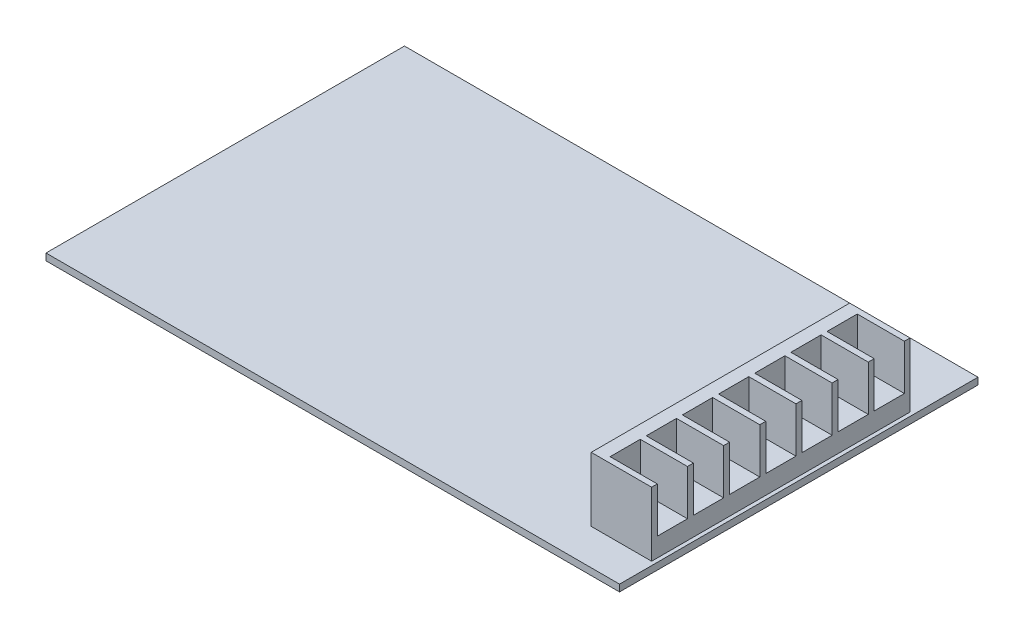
ISO-10303-21;
HEADER;
FILE_DESCRIPTION(('STEP AP214'),'2;1');
FILE_NAME('part.step','',(''),(''),'','','');
FILE_SCHEMA(('AUTOMOTIVE_DESIGN { 1 0 10303 214 1 1 1 1 }'));
ENDSEC;
DATA;
#1=APPLICATION_CONTEXT('core data for automotive mechanical design processes');
#2=APPLICATION_PROTOCOL_DEFINITION('international standard','automotive_design',2000,#1);
#3=PRODUCT_CONTEXT('',#1,'mechanical');
#4=PRODUCT('Part','Part','',(#3));
#5=PRODUCT_RELATED_PRODUCT_CATEGORY('part','',(#4));
#6=PRODUCT_DEFINITION_FORMATION('','',#4);
#7=PRODUCT_DEFINITION_CONTEXT('part definition',#1,'design');
#8=PRODUCT_DEFINITION('design','',#6,#7);
#9=PRODUCT_DEFINITION_SHAPE('','',#8);
#10=(LENGTH_UNIT() NAMED_UNIT(*) SI_UNIT(.MILLI.,.METRE.));
#11=(NAMED_UNIT(*) PLANE_ANGLE_UNIT() SI_UNIT($,.RADIAN.));
#12=(NAMED_UNIT(*) SI_UNIT($,.STERADIAN.) SOLID_ANGLE_UNIT());
#13=UNCERTAINTY_MEASURE_WITH_UNIT(LENGTH_MEASURE(1.E-05),#10,'distance_accuracy_value','');
#14=(GEOMETRIC_REPRESENTATION_CONTEXT(3) GLOBAL_UNCERTAINTY_ASSIGNED_CONTEXT((#13)) GLOBAL_UNIT_ASSIGNED_CONTEXT((#10,
#11,#12)) REPRESENTATION_CONTEXT('',''));
#15=CARTESIAN_POINT('',(0.,0.,0.));
#16=DIRECTION('',(0.,0.,1.));
#17=DIRECTION('',(1.,0.,0.));
#18=AXIS2_PLACEMENT_3D('',#15,#16,#17);
#19=CARTESIAN_POINT('',(0.,1.8,0.));
#20=DIRECTION('',(0.,-1.,0.));
#21=DIRECTION('',(0.,0.,-1.));
#22=AXIS2_PLACEMENT_3D('',#19,#20,#21);
#23=PLANE('',#22);
#24=DIRECTION('',(0.,0.,-1.));
#25=VECTOR('',#24,1.);
#26=CARTESIAN_POINT('',(76.,1.8,47.5));
#27=LINE('',#26,#25);
#28=CARTESIAN_POINT('',(76.,1.8,47.5));
#29=VERTEX_POINT('',#28);
#30=CARTESIAN_POINT('',(76.,1.8,-47.5));
#31=VERTEX_POINT('',#30);
#32=EDGE_CURVE('E515',#29,#31,#27,.T.);
#33=ORIENTED_EDGE('',*,*,#32,.T.);
#34=DIRECTION('',(-1.,0.,0.));
#35=VECTOR('',#34,1.);
#36=CARTESIAN_POINT('',(-76.,1.8,-47.5));
#37=LINE('',#36,#35);
#38=CARTESIAN_POINT('',(-76.,1.8,-47.5));
#39=VERTEX_POINT('',#38);
#40=EDGE_CURVE('E518',#31,#39,#37,.T.);
#41=ORIENTED_EDGE('',*,*,#40,.T.);
#42=DIRECTION('',(0.,0.,1.));
#43=VECTOR('',#42,1.);
#44=CARTESIAN_POINT('',(-76.,1.8,47.5));
#45=LINE('',#44,#43);
#46=CARTESIAN_POINT('',(-76.,1.8,47.5));
#47=VERTEX_POINT('',#46);
#48=EDGE_CURVE('E521',#39,#47,#45,.T.);
#49=ORIENTED_EDGE('',*,*,#48,.T.);
#50=DIRECTION('',(1.,0.,0.));
#51=VECTOR('',#50,1.);
#52=CARTESIAN_POINT('',(-76.,1.8,47.5));
#53=LINE('',#52,#51);
#54=EDGE_CURVE('E523',#47,#29,#53,.T.);
#55=ORIENTED_EDGE('',*,*,#54,.T.);
#56=EDGE_LOOP('',(#33,#41,#49,#55));
#57=FACE_BOUND('',#56,.T.);
#58=DIRECTION('',(0.,0.,-1.));
#59=VECTOR('',#58,1.);
#60=CARTESIAN_POINT('',(75.,1.8,-30.5));
#61=LINE('',#60,#59);
#62=CARTESIAN_POINT('',(75.,1.8,38.));
#63=VERTEX_POINT('',#62);
#64=CARTESIAN_POINT('',(75.,1.8,-30.5));
#65=VERTEX_POINT('',#64);
#66=EDGE_CURVE('E474',#63,#65,#61,.T.);
#67=ORIENTED_EDGE('',*,*,#66,.F.);
#68=DIRECTION('',(1.,0.,0.));
#69=VECTOR('',#68,1.);
#70=CARTESIAN_POINT('',(75.,1.8,38.));
#71=LINE('',#70,#69);
#72=CARTESIAN_POINT('',(59.,1.8,38.));
#73=VERTEX_POINT('',#72);
#74=EDGE_CURVE('E500',#73,#63,#71,.T.);
#75=ORIENTED_EDGE('',*,*,#74,.F.);
#76=DIRECTION('',(0.,0.,1.));
#77=VECTOR('',#76,1.);
#78=CARTESIAN_POINT('',(59.,1.8,-30.5));
#79=LINE('',#78,#77);
#80=CARTESIAN_POINT('',(59.,1.8,-30.5));
#81=VERTEX_POINT('',#80);
#82=EDGE_CURVE('E497',#81,#73,#79,.T.);
#83=ORIENTED_EDGE('',*,*,#82,.F.);
#84=DIRECTION('',(-1.,0.,0.));
#85=VECTOR('',#84,1.);
#86=CARTESIAN_POINT('',(75.,1.8,-30.5));
#87=LINE('',#86,#85);
#88=EDGE_CURVE('E494',#65,#81,#87,.T.);
#89=ORIENTED_EDGE('',*,*,#88,.F.);
#90=EDGE_LOOP('',(#67,#75,#83,#89));
#91=FACE_BOUND('',#90,.T.);
#92=ADVANCED_FACE('F33',(#57,#91),#23,.F.);
#93=CARTESIAN_POINT('',(76.,1.8,47.5));
#94=DIRECTION('',(-1.,0.,0.));
#95=DIRECTION('',(0.,0.,1.));
#96=AXIS2_PLACEMENT_3D('',#93,#94,#95);
#97=PLANE('',#96);
#98=DIRECTION('',(0.,0.,-1.));
#99=VECTOR('',#98,1.);
#100=CARTESIAN_POINT('',(76.,0.,47.5));
#101=LINE('',#100,#99);
#102=CARTESIAN_POINT('',(76.,0.,47.5));
#103=VERTEX_POINT('',#102);
#104=CARTESIAN_POINT('',(76.,0.,-47.5));
#105=VERTEX_POINT('',#104);
#106=EDGE_CURVE('E514',#103,#105,#101,.T.);
#107=ORIENTED_EDGE('',*,*,#106,.T.);
#108=DIRECTION('',(0.,-1.,0.));
#109=VECTOR('',#108,1.);
#110=CARTESIAN_POINT('',(76.,1.8,-47.5));
#111=LINE('',#110,#109);
#112=EDGE_CURVE('E11',#31,#105,#111,.T.);
#113=ORIENTED_EDGE('',*,*,#112,.F.);
#114=ORIENTED_EDGE('',*,*,#32,.F.);
#115=DIRECTION('',(0.,-1.,0.));
#116=VECTOR('',#115,1.);
#117=CARTESIAN_POINT('',(76.,1.8,47.5));
#118=LINE('',#117,#116);
#119=EDGE_CURVE('E525',#29,#103,#118,.T.);
#120=ORIENTED_EDGE('',*,*,#119,.T.);
#121=EDGE_LOOP('',(#107,#113,#114,#120));
#122=FACE_BOUND('',#121,.T.);
#123=ADVANCED_FACE('F35',(#122),#97,.F.);
#124=CARTESIAN_POINT('',(-76.,1.8,-47.5));
#125=DIRECTION('',(0.,0.,1.));
#126=DIRECTION('',(1.,0.,0.));
#127=AXIS2_PLACEMENT_3D('',#124,#125,#126);
#128=PLANE('',#127);
#129=DIRECTION('',(-1.,0.,0.));
#130=VECTOR('',#129,1.);
#131=CARTESIAN_POINT('',(-76.,0.,-47.5));
#132=LINE('',#131,#130);
#133=CARTESIAN_POINT('',(-76.,0.,-47.5));
#134=VERTEX_POINT('',#133);
#135=EDGE_CURVE('E528',#105,#134,#132,.T.);
#136=ORIENTED_EDGE('',*,*,#135,.T.);
#137=DIRECTION('',(0.,-1.,0.));
#138=VECTOR('',#137,1.);
#139=CARTESIAN_POINT('',(-76.,1.8,-47.5));
#140=LINE('',#139,#138);
#141=EDGE_CURVE('E41',#39,#134,#140,.T.);
#142=ORIENTED_EDGE('',*,*,#141,.F.);
#143=ORIENTED_EDGE('',*,*,#40,.F.);
#144=ORIENTED_EDGE('',*,*,#112,.T.);
#145=EDGE_LOOP('',(#136,#142,#143,#144));
#146=FACE_BOUND('',#145,.T.);
#147=ADVANCED_FACE('F558',(#146),#128,.F.);
#148=CARTESIAN_POINT('',(-76.,1.8,47.5));
#149=DIRECTION('',(1.,0.,0.));
#150=DIRECTION('',(0.,0.,-1.));
#151=AXIS2_PLACEMENT_3D('',#148,#149,#150);
#152=PLANE('',#151);
#153=DIRECTION('',(0.,0.,1.));
#154=VECTOR('',#153,1.);
#155=CARTESIAN_POINT('',(-76.,0.,47.5));
#156=LINE('',#155,#154);
#157=CARTESIAN_POINT('',(-76.,0.,47.5));
#158=VERTEX_POINT('',#157);
#159=EDGE_CURVE('E530',#134,#158,#156,.T.);
#160=ORIENTED_EDGE('',*,*,#159,.T.);
#161=DIRECTION('',(0.,-1.,0.));
#162=VECTOR('',#161,1.);
#163=CARTESIAN_POINT('',(-76.,1.8,47.5));
#164=LINE('',#163,#162);
#165=EDGE_CURVE('E535',#47,#158,#164,.T.);
#166=ORIENTED_EDGE('',*,*,#165,.F.);
#167=ORIENTED_EDGE('',*,*,#48,.F.);
#168=ORIENTED_EDGE('',*,*,#141,.T.);
#169=EDGE_LOOP('',(#160,#166,#167,#168));
#170=FACE_BOUND('',#169,.T.);
#171=ADVANCED_FACE('F542',(#170),#152,.F.);
#172=CARTESIAN_POINT('',(-76.,1.8,47.5));
#173=DIRECTION('',(0.,0.,-1.));
#174=DIRECTION('',(-1.,0.,0.));
#175=AXIS2_PLACEMENT_3D('',#172,#173,#174);
#176=PLANE('',#175);
#177=DIRECTION('',(1.,0.,0.));
#178=VECTOR('',#177,1.);
#179=CARTESIAN_POINT('',(-76.,0.,47.5));
#180=LINE('',#179,#178);
#181=EDGE_CURVE('E519',#158,#103,#180,.T.);
#182=ORIENTED_EDGE('',*,*,#181,.T.);
#183=ORIENTED_EDGE('',*,*,#119,.F.);
#184=ORIENTED_EDGE('',*,*,#54,.F.);
#185=ORIENTED_EDGE('',*,*,#165,.T.);
#186=EDGE_LOOP('',(#182,#183,#184,#185));
#187=FACE_BOUND('',#186,.T.);
#188=ADVANCED_FACE('F551',(#187),#176,.F.);
#189=CARTESIAN_POINT('',(0.,0.,0.));
#190=DIRECTION('',(0.,-1.,0.));
#191=DIRECTION('',(0.,0.,-1.));
#192=AXIS2_PLACEMENT_3D('',#189,#190,#191);
#193=PLANE('',#192);
#194=ORIENTED_EDGE('',*,*,#106,.F.);
#195=ORIENTED_EDGE('',*,*,#181,.F.);
#196=ORIENTED_EDGE('',*,*,#159,.F.);
#197=ORIENTED_EDGE('',*,*,#135,.F.);
#198=EDGE_LOOP('',(#194,#195,#196,#197));
#199=FACE_BOUND('',#198,.T.);
#200=ADVANCED_FACE('F548',(#199),#193,.T.);
#201=CARTESIAN_POINT('',(75.,18.8,-30.5));
#202=DIRECTION('',(-1.,0.,0.));
#203=DIRECTION('',(0.,0.,1.));
#204=AXIS2_PLACEMENT_3D('',#201,#202,#203);
#205=PLANE('',#204);
#206=DIRECTION('',(0.,0.,-1.));
#207=VECTOR('',#206,1.);
#208=CARTESIAN_POINT('',(75.,6.80000000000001,26.9166666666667));
#209=LINE('',#208,#207);
#210=CARTESIAN_POINT('',(75.,6.80000000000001,26.9166666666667));
#211=VERTEX_POINT('',#210);
#212=CARTESIAN_POINT('',(75.,6.80000000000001,18.9166666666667));
#213=VERTEX_POINT('',#212);
#214=EDGE_CURVE('E286',#211,#213,#209,.T.);
#215=ORIENTED_EDGE('',*,*,#214,.F.);
#216=DIRECTION('',(0.,1.,0.));
#217=VECTOR('',#216,1.);
#218=CARTESIAN_POINT('',(75.,6.80000000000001,26.9166666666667));
#219=LINE('',#218,#217);
#220=CARTESIAN_POINT('',(75.,18.8,26.9166666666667));
#221=VERTEX_POINT('',#220);
#222=EDGE_CURVE('E268',#211,#221,#219,.T.);
#223=ORIENTED_EDGE('',*,*,#222,.T.);
#224=DIRECTION('',(0.,0.,-1.));
#225=VECTOR('',#224,1.);
#226=CARTESIAN_POINT('',(75.,18.8,-30.5));
#227=LINE('',#226,#225);
#228=CARTESIAN_POINT('',(75.,18.8,28.5));
#229=VERTEX_POINT('',#228);
#230=EDGE_CURVE('E484',#229,#221,#227,.T.);
#231=ORIENTED_EDGE('',*,*,#230,.F.);
#232=DIRECTION('',(0.,1.,0.));
#233=VECTOR('',#232,1.);
#234=CARTESIAN_POINT('',(75.,6.80000000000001,28.5));
#235=LINE('',#234,#233);
#236=CARTESIAN_POINT('',(75.,6.80000000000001,28.5));
#237=VERTEX_POINT('',#236);
#238=EDGE_CURVE('E464',#237,#229,#235,.T.);
#239=ORIENTED_EDGE('',*,*,#238,.F.);
#240=DIRECTION('',(0.,0.,-1.));
#241=VECTOR('',#240,1.);
#242=CARTESIAN_POINT('',(75.,6.80000000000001,36.5));
#243=LINE('',#242,#241);
#244=CARTESIAN_POINT('',(75.,6.80000000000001,36.5));
#245=VERTEX_POINT('',#244);
#246=EDGE_CURVE('E451',#245,#237,#243,.T.);
#247=ORIENTED_EDGE('',*,*,#246,.F.);
#248=DIRECTION('',(0.,1.,0.));
#249=VECTOR('',#248,1.);
#250=CARTESIAN_POINT('',(75.,6.80000000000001,36.5));
#251=LINE('',#250,#249);
#252=CARTESIAN_POINT('',(75.,18.8,36.5));
#253=VERTEX_POINT('',#252);
#254=EDGE_CURVE('E471',#245,#253,#251,.T.);
#255=ORIENTED_EDGE('',*,*,#254,.T.);
#256=CARTESIAN_POINT('',(75.,18.8,38.));
#257=VERTEX_POINT('',#256);
#258=EDGE_CURVE('E480',#257,#253,#227,.T.);
#259=ORIENTED_EDGE('',*,*,#258,.F.);
#260=DIRECTION('',(0.,-1.,0.));
#261=VECTOR('',#260,1.);
#262=CARTESIAN_POINT('',(75.,18.8,38.));
#263=LINE('',#262,#261);
#264=EDGE_CURVE('E491',#257,#63,#263,.T.);
#265=ORIENTED_EDGE('',*,*,#264,.T.);
#266=ORIENTED_EDGE('',*,*,#66,.T.);
#267=DIRECTION('',(0.,-1.,0.));
#268=VECTOR('',#267,1.);
#269=CARTESIAN_POINT('',(75.,18.8,-30.5));
#270=LINE('',#269,#268);
#271=CARTESIAN_POINT('',(75.,18.8,-30.5));
#272=VERTEX_POINT('',#271);
#273=EDGE_CURVE('E511',#272,#65,#270,.T.);
#274=ORIENTED_EDGE('',*,*,#273,.F.);
#275=CARTESIAN_POINT('',(75.,18.8,-29.));
#276=VERTEX_POINT('',#275);
#277=EDGE_CURVE('E485',#276,#272,#227,.T.);
#278=ORIENTED_EDGE('',*,*,#277,.F.);
#279=DIRECTION('',(0.,1.,0.));
#280=VECTOR('',#279,1.);
#281=CARTESIAN_POINT('',(75.,6.80000000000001,-29.));
#282=LINE('',#281,#280);
#283=CARTESIAN_POINT('',(75.,6.80000000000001,-29.));
#284=VERTEX_POINT('',#283);
#285=EDGE_CURVE('E48',#284,#276,#282,.T.);
#286=ORIENTED_EDGE('',*,*,#285,.F.);
#287=DIRECTION('',(0.,0.,-1.));
#288=VECTOR('',#287,1.);
#289=CARTESIAN_POINT('',(75.,6.80000000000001,-21.));
#290=LINE('',#289,#288);
#291=CARTESIAN_POINT('',(75.,6.80000000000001,-21.));
#292=VERTEX_POINT('',#291);
#293=EDGE_CURVE('E428',#292,#284,#290,.T.);
#294=ORIENTED_EDGE('',*,*,#293,.F.);
#295=DIRECTION('',(0.,1.,0.));
#296=VECTOR('',#295,1.);
#297=CARTESIAN_POINT('',(75.,6.80000000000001,-21.));
#298=LINE('',#297,#296);
#299=CARTESIAN_POINT('',(75.,18.8,-21.));
#300=VERTEX_POINT('',#299);
#301=EDGE_CURVE('E438',#292,#300,#298,.T.);
#302=ORIENTED_EDGE('',*,*,#301,.T.);
#303=CARTESIAN_POINT('',(75.,18.8,-19.4166666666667));
#304=VERTEX_POINT('',#303);
#305=EDGE_CURVE('E947',#304,#300,#227,.T.);
#306=ORIENTED_EDGE('',*,*,#305,.F.);
#307=DIRECTION('',(0.,1.,0.));
#308=VECTOR('',#307,1.);
#309=CARTESIAN_POINT('',(75.,6.80000000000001,-19.4166666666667));
#310=LINE('',#309,#308);
#311=CARTESIAN_POINT('',(75.,6.80000000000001,-19.4166666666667));
#312=VERTEX_POINT('',#311);
#313=EDGE_CURVE('E56',#312,#304,#310,.T.);
#314=ORIENTED_EDGE('',*,*,#313,.F.);
#315=DIRECTION('',(0.,0.,-1.));
#316=VECTOR('',#315,1.);
#317=CARTESIAN_POINT('',(75.,6.80000000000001,-11.4166666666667));
#318=LINE('',#317,#316);
#319=CARTESIAN_POINT('',(75.,6.80000000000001,-11.4166666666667));
#320=VERTEX_POINT('',#319);
#321=EDGE_CURVE('E401',#320,#312,#318,.T.);
#322=ORIENTED_EDGE('',*,*,#321,.F.);
#323=DIRECTION('',(0.,1.,0.));
#324=VECTOR('',#323,1.);
#325=CARTESIAN_POINT('',(75.,6.80000000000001,-11.4166666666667));
#326=LINE('',#325,#324);
#327=CARTESIAN_POINT('',(75.,18.8,-11.4166666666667));
#328=VERTEX_POINT('',#327);
#329=EDGE_CURVE('E411',#320,#328,#326,.T.);
#330=ORIENTED_EDGE('',*,*,#329,.T.);
#331=CARTESIAN_POINT('',(75.,18.8,-9.83333333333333));
#332=VERTEX_POINT('',#331);
#333=EDGE_CURVE('E942',#332,#328,#227,.T.);
#334=ORIENTED_EDGE('',*,*,#333,.F.);
#335=DIRECTION('',(0.,1.,0.));
#336=VECTOR('',#335,1.);
#337=CARTESIAN_POINT('',(75.,6.80000000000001,-9.83333333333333));
#338=LINE('',#337,#336);
#339=CARTESIAN_POINT('',(75.,6.80000000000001,-9.83333333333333));
#340=VERTEX_POINT('',#339);
#341=EDGE_CURVE('E394',#340,#332,#338,.T.);
#342=ORIENTED_EDGE('',*,*,#341,.F.);
#343=DIRECTION('',(0.,0.,-1.));
#344=VECTOR('',#343,1.);
#345=CARTESIAN_POINT('',(75.,6.80000000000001,-1.83333333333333));
#346=LINE('',#345,#344);
#347=CARTESIAN_POINT('',(75.,6.80000000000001,-1.83333333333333));
#348=VERTEX_POINT('',#347);
#349=EDGE_CURVE('E372',#348,#340,#346,.T.);
#350=ORIENTED_EDGE('',*,*,#349,.F.);
#351=DIRECTION('',(0.,1.,0.));
#352=VECTOR('',#351,1.);
#353=CARTESIAN_POINT('',(75.,6.80000000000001,-1.83333333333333));
#354=LINE('',#353,#352);
#355=CARTESIAN_POINT('',(75.,18.8,-1.83333333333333));
#356=VERTEX_POINT('',#355);
#357=EDGE_CURVE('E382',#348,#356,#354,.T.);
#358=ORIENTED_EDGE('',*,*,#357,.T.);
#359=CARTESIAN_POINT('',(75.,18.8,-0.25));
#360=VERTEX_POINT('',#359);
#361=EDGE_CURVE('E937',#360,#356,#227,.T.);
#362=ORIENTED_EDGE('',*,*,#361,.F.);
#363=DIRECTION('',(0.,1.,0.));
#364=VECTOR('',#363,1.);
#365=CARTESIAN_POINT('',(75.,6.80000000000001,-0.25));
#366=LINE('',#365,#364);
#367=CARTESIAN_POINT('',(75.,6.80000000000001,-0.25));
#368=VERTEX_POINT('',#367);
#369=EDGE_CURVE('E365',#368,#360,#366,.T.);
#370=ORIENTED_EDGE('',*,*,#369,.F.);
#371=DIRECTION('',(0.,0.,-1.));
#372=VECTOR('',#371,1.);
#373=CARTESIAN_POINT('',(75.,6.80000000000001,7.75));
#374=LINE('',#373,#372);
#375=CARTESIAN_POINT('',(75.,6.80000000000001,7.75));
#376=VERTEX_POINT('',#375);
#377=EDGE_CURVE('E343',#376,#368,#374,.T.);
#378=ORIENTED_EDGE('',*,*,#377,.F.);
#379=DIRECTION('',(0.,1.,0.));
#380=VECTOR('',#379,1.);
#381=CARTESIAN_POINT('',(75.,6.80000000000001,7.75));
#382=LINE('',#381,#380);
#383=CARTESIAN_POINT('',(75.,18.8,7.75));
#384=VERTEX_POINT('',#383);
#385=EDGE_CURVE('E353',#376,#384,#382,.T.);
#386=ORIENTED_EDGE('',*,*,#385,.T.);
#387=CARTESIAN_POINT('',(75.,18.8,9.33333333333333));
#388=VERTEX_POINT('',#387);
#389=EDGE_CURVE('E934',#388,#384,#227,.T.);
#390=ORIENTED_EDGE('',*,*,#389,.F.);
#391=DIRECTION('',(0.,1.,0.));
#392=VECTOR('',#391,1.);
#393=CARTESIAN_POINT('',(75.,6.80000000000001,9.33333333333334));
#394=LINE('',#393,#392);
#395=CARTESIAN_POINT('',(75.,6.80000000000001,9.33333333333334));
#396=VERTEX_POINT('',#395);
#397=EDGE_CURVE('E336',#396,#388,#394,.T.);
#398=ORIENTED_EDGE('',*,*,#397,.F.);
#399=DIRECTION('',(0.,0.,-1.));
#400=VECTOR('',#399,1.);
#401=CARTESIAN_POINT('',(75.,6.80000000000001,17.3333333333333));
#402=LINE('',#401,#400);
#403=CARTESIAN_POINT('',(75.,6.80000000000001,17.3333333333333));
#404=VERTEX_POINT('',#403);
#405=EDGE_CURVE('E314',#404,#396,#402,.T.);
#406=ORIENTED_EDGE('',*,*,#405,.F.);
#407=DIRECTION('',(0.,1.,0.));
#408=VECTOR('',#407,1.);
#409=CARTESIAN_POINT('',(75.,6.80000000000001,17.3333333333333));
#410=LINE('',#409,#408);
#411=CARTESIAN_POINT('',(75.,18.8,17.3333333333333));
#412=VERTEX_POINT('',#411);
#413=EDGE_CURVE('E324',#404,#412,#410,.T.);
#414=ORIENTED_EDGE('',*,*,#413,.T.);
#415=CARTESIAN_POINT('',(75.,18.8,18.9166666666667));
#416=VERTEX_POINT('',#415);
#417=EDGE_CURVE('E933',#416,#412,#227,.T.);
#418=ORIENTED_EDGE('',*,*,#417,.F.);
#419=DIRECTION('',(0.,1.,0.));
#420=VECTOR('',#419,1.);
#421=CARTESIAN_POINT('',(75.,6.80000000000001,18.9166666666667));
#422=LINE('',#421,#420);
#423=EDGE_CURVE('E279',#213,#416,#422,.T.);
#424=ORIENTED_EDGE('',*,*,#423,.F.);
#425=EDGE_LOOP('',(#215,#223,#231,#239,#247,#255,#259,#265,#266,#274,#278,#286,#294,#302,#306,
#314,#322,#330,#334,#342,#350,#358,#362,#370,#378,#386,#390,#398,#406,#414,#418,#424));
#426=FACE_BOUND('',#425,.T.);
#427=ADVANCED_FACE('F291',(#426),#205,.F.);
#428=CARTESIAN_POINT('',(75.,18.8,-30.5));
#429=DIRECTION('',(0.,0.,1.));
#430=DIRECTION('',(1.,0.,0.));
#431=AXIS2_PLACEMENT_3D('',#428,#429,#430);
#432=PLANE('',#431);
#433=ORIENTED_EDGE('',*,*,#88,.T.);
#434=DIRECTION('',(0.,-1.,0.));
#435=VECTOR('',#434,1.);
#436=CARTESIAN_POINT('',(59.,18.8,-30.5));
#437=LINE('',#436,#435);
#438=CARTESIAN_POINT('',(59.,18.8,-30.5));
#439=VERTEX_POINT('',#438);
#440=EDGE_CURVE('E508',#439,#81,#437,.T.);
#441=ORIENTED_EDGE('',*,*,#440,.F.);
#442=DIRECTION('',(-1.,0.,0.));
#443=VECTOR('',#442,1.);
#444=CARTESIAN_POINT('',(75.,18.8,-30.5));
#445=LINE('',#444,#443);
#446=EDGE_CURVE('E483',#272,#439,#445,.T.);
#447=ORIENTED_EDGE('',*,*,#446,.F.);
#448=ORIENTED_EDGE('',*,*,#273,.T.);
#449=EDGE_LOOP('',(#433,#441,#447,#448));
#450=FACE_BOUND('',#449,.T.);
#451=ADVANCED_FACE('F589',(#450),#432,.F.);
#452=CARTESIAN_POINT('',(59.,18.8,-30.5));
#453=DIRECTION('',(1.,0.,0.));
#454=DIRECTION('',(0.,0.,-1.));
#455=AXIS2_PLACEMENT_3D('',#452,#453,#454);
#456=PLANE('',#455);
#457=ORIENTED_EDGE('',*,*,#82,.T.);
#458=DIRECTION('',(0.,-1.,0.));
#459=VECTOR('',#458,1.);
#460=CARTESIAN_POINT('',(59.,18.8,38.));
#461=LINE('',#460,#459);
#462=CARTESIAN_POINT('',(59.,18.8,38.));
#463=VERTEX_POINT('',#462);
#464=EDGE_CURVE('E505',#463,#73,#461,.T.);
#465=ORIENTED_EDGE('',*,*,#464,.F.);
#466=DIRECTION('',(0.,0.,1.));
#467=VECTOR('',#466,1.);
#468=CARTESIAN_POINT('',(59.,18.8,-30.5));
#469=LINE('',#468,#467);
#470=EDGE_CURVE('E487',#439,#463,#469,.T.);
#471=ORIENTED_EDGE('',*,*,#470,.F.);
#472=ORIENTED_EDGE('',*,*,#440,.T.);
#473=EDGE_LOOP('',(#457,#465,#471,#472));
#474=FACE_BOUND('',#473,.T.);
#475=ADVANCED_FACE('F597',(#474),#456,.F.);
#476=CARTESIAN_POINT('',(75.,18.8,38.));
#477=DIRECTION('',(0.,0.,-1.));
#478=DIRECTION('',(-1.,0.,0.));
#479=AXIS2_PLACEMENT_3D('',#476,#477,#478);
#480=PLANE('',#479);
#481=ORIENTED_EDGE('',*,*,#74,.T.);
#482=ORIENTED_EDGE('',*,*,#264,.F.);
#483=DIRECTION('',(1.,0.,0.));
#484=VECTOR('',#483,1.);
#485=CARTESIAN_POINT('',(75.,18.8,38.));
#486=LINE('',#485,#484);
#487=EDGE_CURVE('E489',#463,#257,#486,.T.);
#488=ORIENTED_EDGE('',*,*,#487,.F.);
#489=ORIENTED_EDGE('',*,*,#464,.T.);
#490=EDGE_LOOP('',(#481,#482,#488,#489));
#491=FACE_BOUND('',#490,.T.);
#492=ADVANCED_FACE('F604',(#491),#480,.F.);
#493=CARTESIAN_POINT('',(0.,18.8,0.));
#494=DIRECTION('',(0.,-1.,0.));
#495=DIRECTION('',(0.,0.,-1.));
#496=AXIS2_PLACEMENT_3D('',#493,#494,#495);
#497=PLANE('',#496);
#498=ORIENTED_EDGE('',*,*,#230,.T.);
#499=DIRECTION('',(1.,0.,0.));
#500=VECTOR('',#499,1.);
#501=CARTESIAN_POINT('',(75.,18.8,26.9166666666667));
#502=LINE('',#501,#500);
#503=CARTESIAN_POINT('',(62.5,18.8,26.9166666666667));
#504=VERTEX_POINT('',#503);
#505=EDGE_CURVE('E274',#504,#221,#502,.T.);
#506=ORIENTED_EDGE('',*,*,#505,.F.);
#507=DIRECTION('',(0.,0.,1.));
#508=VECTOR('',#507,1.);
#509=CARTESIAN_POINT('',(62.5,18.8,26.9166666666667));
#510=LINE('',#509,#508);
#511=CARTESIAN_POINT('',(62.5,18.8,18.9166666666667));
#512=VERTEX_POINT('',#511);
#513=EDGE_CURVE('E289',#512,#504,#510,.T.);
#514=ORIENTED_EDGE('',*,*,#513,.F.);
#515=DIRECTION('',(-1.,0.,0.));
#516=VECTOR('',#515,1.);
#517=CARTESIAN_POINT('',(75.,18.8,18.9166666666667));
#518=LINE('',#517,#516);
#519=EDGE_CURVE('E299',#416,#512,#518,.T.);
#520=ORIENTED_EDGE('',*,*,#519,.F.);
#521=ORIENTED_EDGE('',*,*,#417,.T.);
#522=DIRECTION('',(1.,0.,0.));
#523=VECTOR('',#522,1.);
#524=CARTESIAN_POINT('',(75.,18.8,17.3333333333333));
#525=LINE('',#524,#523);
#526=CARTESIAN_POINT('',(62.5,18.8,17.3333333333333));
#527=VERTEX_POINT('',#526);
#528=EDGE_CURVE('E325',#527,#412,#525,.T.);
#529=ORIENTED_EDGE('',*,*,#528,.F.);
#530=DIRECTION('',(0.,0.,1.));
#531=VECTOR('',#530,1.);
#532=CARTESIAN_POINT('',(62.5,18.8,17.3333333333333));
#533=LINE('',#532,#531);
#534=CARTESIAN_POINT('',(62.5,18.8,9.33333333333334));
#535=VERTEX_POINT('',#534);
#536=EDGE_CURVE('E315',#535,#527,#533,.T.);
#537=ORIENTED_EDGE('',*,*,#536,.F.);
#538=DIRECTION('',(-1.,0.,0.));
#539=VECTOR('',#538,1.);
#540=CARTESIAN_POINT('',(75.,18.8,9.33333333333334));
#541=LINE('',#540,#539);
#542=EDGE_CURVE('E327',#388,#535,#541,.T.);
#543=ORIENTED_EDGE('',*,*,#542,.F.);
#544=ORIENTED_EDGE('',*,*,#389,.T.);
#545=DIRECTION('',(1.,0.,0.));
#546=VECTOR('',#545,1.);
#547=CARTESIAN_POINT('',(75.,18.8,7.75));
#548=LINE('',#547,#546);
#549=CARTESIAN_POINT('',(62.5,18.8,7.75));
#550=VERTEX_POINT('',#549);
#551=EDGE_CURVE('E354',#550,#384,#548,.T.);
#552=ORIENTED_EDGE('',*,*,#551,.F.);
#553=DIRECTION('',(0.,0.,1.));
#554=VECTOR('',#553,1.);
#555=CARTESIAN_POINT('',(62.5,18.8,7.75));
#556=LINE('',#555,#554);
#557=CARTESIAN_POINT('',(62.5,18.8,-0.25));
#558=VERTEX_POINT('',#557);
#559=EDGE_CURVE('E344',#558,#550,#556,.T.);
#560=ORIENTED_EDGE('',*,*,#559,.F.);
#561=DIRECTION('',(-1.,0.,0.));
#562=VECTOR('',#561,1.);
#563=CARTESIAN_POINT('',(75.,18.8,-0.25));
#564=LINE('',#563,#562);
#565=EDGE_CURVE('E356',#360,#558,#564,.T.);
#566=ORIENTED_EDGE('',*,*,#565,.F.);
#567=ORIENTED_EDGE('',*,*,#361,.T.);
#568=DIRECTION('',(1.,0.,0.));
#569=VECTOR('',#568,1.);
#570=CARTESIAN_POINT('',(75.,18.8,-1.83333333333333));
#571=LINE('',#570,#569);
#572=CARTESIAN_POINT('',(62.5,18.8,-1.83333333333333));
#573=VERTEX_POINT('',#572);
#574=EDGE_CURVE('E383',#573,#356,#571,.T.);
#575=ORIENTED_EDGE('',*,*,#574,.F.);
#576=DIRECTION('',(0.,0.,1.));
#577=VECTOR('',#576,1.);
#578=CARTESIAN_POINT('',(62.5,18.8,-1.83333333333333));
#579=LINE('',#578,#577);
#580=CARTESIAN_POINT('',(62.5,18.8,-9.83333333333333));
#581=VERTEX_POINT('',#580);
#582=EDGE_CURVE('E373',#581,#573,#579,.T.);
#583=ORIENTED_EDGE('',*,*,#582,.F.);
#584=DIRECTION('',(-1.,0.,0.));
#585=VECTOR('',#584,1.);
#586=CARTESIAN_POINT('',(75.,18.8,-9.83333333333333));
#587=LINE('',#586,#585);
#588=EDGE_CURVE('E385',#332,#581,#587,.T.);
#589=ORIENTED_EDGE('',*,*,#588,.F.);
#590=ORIENTED_EDGE('',*,*,#333,.T.);
#591=DIRECTION('',(1.,0.,0.));
#592=VECTOR('',#591,1.);
#593=CARTESIAN_POINT('',(75.,18.8,-11.4166666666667));
#594=LINE('',#593,#592);
#595=CARTESIAN_POINT('',(62.5,18.8,-11.4166666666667));
#596=VERTEX_POINT('',#595);
#597=EDGE_CURVE('E412',#596,#328,#594,.T.);
#598=ORIENTED_EDGE('',*,*,#597,.F.);
#599=DIRECTION('',(0.,0.,1.));
#600=VECTOR('',#599,1.);
#601=CARTESIAN_POINT('',(62.5,18.8,-11.4166666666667));
#602=LINE('',#601,#600);
#603=CARTESIAN_POINT('',(62.5,18.8,-19.4166666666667));
#604=VERTEX_POINT('',#603);
#605=EDGE_CURVE('E402',#604,#596,#602,.T.);
#606=ORIENTED_EDGE('',*,*,#605,.F.);
#607=DIRECTION('',(-1.,0.,0.));
#608=VECTOR('',#607,1.);
#609=CARTESIAN_POINT('',(75.,18.8,-19.4166666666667));
#610=LINE('',#609,#608);
#611=EDGE_CURVE('E414',#304,#604,#610,.T.);
#612=ORIENTED_EDGE('',*,*,#611,.F.);
#613=ORIENTED_EDGE('',*,*,#305,.T.);
#614=DIRECTION('',(1.,0.,0.));
#615=VECTOR('',#614,1.);
#616=CARTESIAN_POINT('',(75.,18.8,-21.));
#617=LINE('',#616,#615);
#618=CARTESIAN_POINT('',(62.5,18.8,-21.));
#619=VERTEX_POINT('',#618);
#620=EDGE_CURVE('E439',#619,#300,#617,.T.);
#621=ORIENTED_EDGE('',*,*,#620,.F.);
#622=DIRECTION('',(0.,0.,1.));
#623=VECTOR('',#622,1.);
#624=CARTESIAN_POINT('',(62.5,18.8,-21.));
#625=LINE('',#624,#623);
#626=CARTESIAN_POINT('',(62.5,18.8,-29.));
#627=VERTEX_POINT('',#626);
#628=EDGE_CURVE('E429',#627,#619,#625,.T.);
#629=ORIENTED_EDGE('',*,*,#628,.F.);
#630=DIRECTION('',(-1.,0.,0.));
#631=VECTOR('',#630,1.);
#632=CARTESIAN_POINT('',(75.,18.8,-29.));
#633=LINE('',#632,#631);
#634=EDGE_CURVE('E441',#276,#627,#633,.T.);
#635=ORIENTED_EDGE('',*,*,#634,.F.);
#636=ORIENTED_EDGE('',*,*,#277,.T.);
#637=ORIENTED_EDGE('',*,*,#446,.T.);
#638=ORIENTED_EDGE('',*,*,#470,.T.);
#639=ORIENTED_EDGE('',*,*,#487,.T.);
#640=ORIENTED_EDGE('',*,*,#258,.T.);
#641=DIRECTION('',(1.,0.,0.));
#642=VECTOR('',#641,1.);
#643=CARTESIAN_POINT('',(75.,18.8,36.5));
#644=LINE('',#643,#642);
#645=CARTESIAN_POINT('',(62.5,18.8,36.5));
#646=VERTEX_POINT('',#645);
#647=EDGE_CURVE('E455',#646,#253,#644,.T.);
#648=ORIENTED_EDGE('',*,*,#647,.F.);
#649=DIRECTION('',(0.,0.,1.));
#650=VECTOR('',#649,1.);
#651=CARTESIAN_POINT('',(62.5,18.8,36.5));
#652=LINE('',#651,#650);
#653=CARTESIAN_POINT('',(62.5,18.8,28.5));
#654=VERTEX_POINT('',#653);
#655=EDGE_CURVE('E467',#654,#646,#652,.T.);
#656=ORIENTED_EDGE('',*,*,#655,.F.);
#657=DIRECTION('',(-1.,0.,0.));
#658=VECTOR('',#657,1.);
#659=CARTESIAN_POINT('',(75.,18.8,28.5));
#660=LINE('',#659,#658);
#661=EDGE_CURVE('E307',#229,#654,#660,.T.);
#662=ORIENTED_EDGE('',*,*,#661,.F.);
#663=EDGE_LOOP('',(#498,#506,#514,#520,#521,#529,#537,#543,#544,#552,#560,#566,#567,#575,#583,
#589,#590,#598,#606,#612,#613,#621,#629,#635,#636,#637,#638,#639,#640,#648,#656,#662));
#664=FACE_BOUND('',#663,.T.);
#665=ADVANCED_FACE('F611',(#664),#497,.F.);
#666=CARTESIAN_POINT('',(75.,6.80000000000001,36.5));
#667=DIRECTION('',(0.,0.,1.));
#668=DIRECTION('',(1.,0.,0.));
#669=AXIS2_PLACEMENT_3D('',#666,#667,#668);
#670=PLANE('',#669);
#671=ORIENTED_EDGE('',*,*,#647,.T.);
#672=ORIENTED_EDGE('',*,*,#254,.F.);
#673=DIRECTION('',(1.,0.,0.));
#674=VECTOR('',#673,1.);
#675=CARTESIAN_POINT('',(75.,6.80000000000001,36.5));
#676=LINE('',#675,#674);
#677=CARTESIAN_POINT('',(62.5,6.80000000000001,36.5));
#678=VERTEX_POINT('',#677);
#679=EDGE_CURVE('E461',#678,#245,#676,.T.);
#680=ORIENTED_EDGE('',*,*,#679,.F.);
#681=DIRECTION('',(0.,1.,0.));
#682=VECTOR('',#681,1.);
#683=CARTESIAN_POINT('',(62.5,6.80000000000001,36.5));
#684=LINE('',#683,#682);
#685=EDGE_CURVE('E475',#678,#646,#684,.T.);
#686=ORIENTED_EDGE('',*,*,#685,.T.);
#687=EDGE_LOOP('',(#671,#672,#680,#686));
#688=FACE_BOUND('',#687,.T.);
#689=ADVANCED_FACE('F618',(#688),#670,.F.);
#690=CARTESIAN_POINT('',(62.5,6.80000000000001,36.5));
#691=DIRECTION('',(-1.,0.,0.));
#692=DIRECTION('',(0.,0.,1.));
#693=AXIS2_PLACEMENT_3D('',#690,#691,#692);
#694=PLANE('',#693);
#695=ORIENTED_EDGE('',*,*,#655,.T.);
#696=ORIENTED_EDGE('',*,*,#685,.F.);
#697=DIRECTION('',(0.,0.,1.));
#698=VECTOR('',#697,1.);
#699=CARTESIAN_POINT('',(62.5,6.80000000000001,36.5));
#700=LINE('',#699,#698);
#701=CARTESIAN_POINT('',(62.5,6.80000000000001,28.5));
#702=VERTEX_POINT('',#701);
#703=EDGE_CURVE('E458',#702,#678,#700,.T.);
#704=ORIENTED_EDGE('',*,*,#703,.F.);
#705=DIRECTION('',(0.,1.,0.));
#706=VECTOR('',#705,1.);
#707=CARTESIAN_POINT('',(62.5,6.80000000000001,28.5));
#708=LINE('',#707,#706);
#709=EDGE_CURVE('E477',#702,#654,#708,.T.);
#710=ORIENTED_EDGE('',*,*,#709,.T.);
#711=EDGE_LOOP('',(#695,#696,#704,#710));
#712=FACE_BOUND('',#711,.T.);
#713=ADVANCED_FACE('F626',(#712),#694,.F.);
#714=CARTESIAN_POINT('',(75.,6.80000000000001,28.5));
#715=DIRECTION('',(0.,0.,-1.));
#716=DIRECTION('',(-1.,0.,0.));
#717=AXIS2_PLACEMENT_3D('',#714,#715,#716);
#718=PLANE('',#717);
#719=ORIENTED_EDGE('',*,*,#661,.T.);
#720=ORIENTED_EDGE('',*,*,#709,.F.);
#721=DIRECTION('',(-1.,0.,0.));
#722=VECTOR('',#721,1.);
#723=CARTESIAN_POINT('',(75.,6.80000000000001,28.5));
#724=LINE('',#723,#722);
#725=EDGE_CURVE('E454',#237,#702,#724,.T.);
#726=ORIENTED_EDGE('',*,*,#725,.F.);
#727=ORIENTED_EDGE('',*,*,#238,.T.);
#728=EDGE_LOOP('',(#719,#720,#726,#727));
#729=FACE_BOUND('',#728,.T.);
#730=ADVANCED_FACE('F634',(#729),#718,.F.);
#731=CARTESIAN_POINT('',(0.,6.80000000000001,0.));
#732=DIRECTION('',(0.,1.,0.));
#733=DIRECTION('',(0.,0.,1.));
#734=AXIS2_PLACEMENT_3D('',#731,#732,#733);
#735=PLANE('',#734);
#736=ORIENTED_EDGE('',*,*,#246,.T.);
#737=ORIENTED_EDGE('',*,*,#725,.T.);
#738=ORIENTED_EDGE('',*,*,#703,.T.);
#739=ORIENTED_EDGE('',*,*,#679,.T.);
#740=EDGE_LOOP('',(#736,#737,#738,#739));
#741=FACE_BOUND('',#740,.T.);
#742=ADVANCED_FACE('F642',(#741),#735,.T.);
#743=CARTESIAN_POINT('',(75.,6.80000000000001,-21.));
#744=DIRECTION('',(0.,0.,1.));
#745=DIRECTION('',(1.,0.,0.));
#746=AXIS2_PLACEMENT_3D('',#743,#744,#745);
#747=PLANE('',#746);
#748=ORIENTED_EDGE('',*,*,#620,.T.);
#749=ORIENTED_EDGE('',*,*,#301,.F.);
#750=DIRECTION('',(1.,0.,0.));
#751=VECTOR('',#750,1.);
#752=CARTESIAN_POINT('',(75.,6.80000000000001,-21.));
#753=LINE('',#752,#751);
#754=CARTESIAN_POINT('',(62.5,6.80000000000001,-21.));
#755=VERTEX_POINT('',#754);
#756=EDGE_CURVE('E425',#755,#292,#753,.T.);
#757=ORIENTED_EDGE('',*,*,#756,.F.);
#758=DIRECTION('',(0.,1.,0.));
#759=VECTOR('',#758,1.);
#760=CARTESIAN_POINT('',(62.5,6.80000000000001,-21.));
#761=LINE('',#760,#759);
#762=EDGE_CURVE('E415',#755,#619,#761,.T.);
#763=ORIENTED_EDGE('',*,*,#762,.T.);
#764=EDGE_LOOP('',(#748,#749,#757,#763));
#765=FACE_BOUND('',#764,.T.);
#766=ADVANCED_FACE('F650',(#765),#747,.F.);
#767=CARTESIAN_POINT('',(62.5,6.80000000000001,-21.));
#768=DIRECTION('',(-1.,0.,0.));
#769=DIRECTION('',(0.,0.,1.));
#770=AXIS2_PLACEMENT_3D('',#767,#768,#769);
#771=PLANE('',#770);
#772=ORIENTED_EDGE('',*,*,#628,.T.);
#773=ORIENTED_EDGE('',*,*,#762,.F.);
#774=DIRECTION('',(0.,0.,1.));
#775=VECTOR('',#774,1.);
#776=CARTESIAN_POINT('',(62.5,6.80000000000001,-21.));
#777=LINE('',#776,#775);
#778=CARTESIAN_POINT('',(62.5,6.80000000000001,-29.));
#779=VERTEX_POINT('',#778);
#780=EDGE_CURVE('E435',#779,#755,#777,.T.);
#781=ORIENTED_EDGE('',*,*,#780,.F.);
#782=DIRECTION('',(0.,1.,0.));
#783=VECTOR('',#782,1.);
#784=CARTESIAN_POINT('',(62.5,6.80000000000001,-29.));
#785=LINE('',#784,#783);
#786=EDGE_CURVE('E446',#779,#627,#785,.T.);
#787=ORIENTED_EDGE('',*,*,#786,.T.);
#788=EDGE_LOOP('',(#772,#773,#781,#787));
#789=FACE_BOUND('',#788,.T.);
#790=ADVANCED_FACE('F658',(#789),#771,.F.);
#791=CARTESIAN_POINT('',(75.,6.80000000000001,-29.));
#792=DIRECTION('',(0.,0.,-1.));
#793=DIRECTION('',(-1.,0.,0.));
#794=AXIS2_PLACEMENT_3D('',#791,#792,#793);
#795=PLANE('',#794);
#796=ORIENTED_EDGE('',*,*,#634,.T.);
#797=ORIENTED_EDGE('',*,*,#786,.F.);
#798=DIRECTION('',(-1.,0.,0.));
#799=VECTOR('',#798,1.);
#800=CARTESIAN_POINT('',(75.,6.80000000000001,-29.));
#801=LINE('',#800,#799);
#802=EDGE_CURVE('E432',#284,#779,#801,.T.);
#803=ORIENTED_EDGE('',*,*,#802,.F.);
#804=ORIENTED_EDGE('',*,*,#285,.T.);
#805=EDGE_LOOP('',(#796,#797,#803,#804));
#806=FACE_BOUND('',#805,.T.);
#807=ADVANCED_FACE('F666',(#806),#795,.F.);
#808=CARTESIAN_POINT('',(0.,6.80000000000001,0.));
#809=DIRECTION('',(0.,-1.,0.));
#810=DIRECTION('',(0.,0.,-1.));
#811=AXIS2_PLACEMENT_3D('',#808,#809,#810);
#812=PLANE('',#811);
#813=ORIENTED_EDGE('',*,*,#756,.T.);
#814=ORIENTED_EDGE('',*,*,#293,.T.);
#815=ORIENTED_EDGE('',*,*,#802,.T.);
#816=ORIENTED_EDGE('',*,*,#780,.T.);
#817=EDGE_LOOP('',(#813,#814,#815,#816));
#818=FACE_BOUND('',#817,.T.);
#819=ADVANCED_FACE('F674',(#818),#812,.F.);
#820=CARTESIAN_POINT('',(75.,6.80000000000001,-11.4166666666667));
#821=DIRECTION('',(0.,0.,1.));
#822=DIRECTION('',(1.,0.,0.));
#823=AXIS2_PLACEMENT_3D('',#820,#821,#822);
#824=PLANE('',#823);
#825=ORIENTED_EDGE('',*,*,#597,.T.);
#826=ORIENTED_EDGE('',*,*,#329,.F.);
#827=DIRECTION('',(1.,0.,0.));
#828=VECTOR('',#827,1.);
#829=CARTESIAN_POINT('',(75.,6.80000000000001,-11.4166666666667));
#830=LINE('',#829,#828);
#831=CARTESIAN_POINT('',(62.5,6.80000000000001,-11.4166666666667));
#832=VERTEX_POINT('',#831);
#833=EDGE_CURVE('E398',#832,#320,#830,.T.);
#834=ORIENTED_EDGE('',*,*,#833,.F.);
#835=DIRECTION('',(0.,1.,0.));
#836=VECTOR('',#835,1.);
#837=CARTESIAN_POINT('',(62.5,6.80000000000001,-11.4166666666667));
#838=LINE('',#837,#836);
#839=EDGE_CURVE('E386',#832,#596,#838,.T.);
#840=ORIENTED_EDGE('',*,*,#839,.T.);
#841=EDGE_LOOP('',(#825,#826,#834,#840));
#842=FACE_BOUND('',#841,.T.);
#843=ADVANCED_FACE('F681',(#842),#824,.F.);
#844=CARTESIAN_POINT('',(62.5,6.80000000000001,-11.4166666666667));
#845=DIRECTION('',(-1.,0.,0.));
#846=DIRECTION('',(0.,0.,1.));
#847=AXIS2_PLACEMENT_3D('',#844,#845,#846);
#848=PLANE('',#847);
#849=ORIENTED_EDGE('',*,*,#605,.T.);
#850=ORIENTED_EDGE('',*,*,#839,.F.);
#851=DIRECTION('',(0.,0.,1.));
#852=VECTOR('',#851,1.);
#853=CARTESIAN_POINT('',(62.5,6.80000000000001,-11.4166666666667));
#854=LINE('',#853,#852);
#855=CARTESIAN_POINT('',(62.5,6.80000000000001,-19.4166666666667));
#856=VERTEX_POINT('',#855);
#857=EDGE_CURVE('E408',#856,#832,#854,.T.);
#858=ORIENTED_EDGE('',*,*,#857,.F.);
#859=DIRECTION('',(0.,1.,0.));
#860=VECTOR('',#859,1.);
#861=CARTESIAN_POINT('',(62.5,6.80000000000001,-19.4166666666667));
#862=LINE('',#861,#860);
#863=EDGE_CURVE('E420',#856,#604,#862,.T.);
#864=ORIENTED_EDGE('',*,*,#863,.T.);
#865=EDGE_LOOP('',(#849,#850,#858,#864));
#866=FACE_BOUND('',#865,.T.);
#867=ADVANCED_FACE('F689',(#866),#848,.F.);
#868=CARTESIAN_POINT('',(75.,6.80000000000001,-19.4166666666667));
#869=DIRECTION('',(0.,0.,-1.));
#870=DIRECTION('',(-1.,0.,0.));
#871=AXIS2_PLACEMENT_3D('',#868,#869,#870);
#872=PLANE('',#871);
#873=ORIENTED_EDGE('',*,*,#611,.T.);
#874=ORIENTED_EDGE('',*,*,#863,.F.);
#875=DIRECTION('',(-1.,0.,0.));
#876=VECTOR('',#875,1.);
#877=CARTESIAN_POINT('',(75.,6.80000000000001,-19.4166666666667));
#878=LINE('',#877,#876);
#879=EDGE_CURVE('E405',#312,#856,#878,.T.);
#880=ORIENTED_EDGE('',*,*,#879,.F.);
#881=ORIENTED_EDGE('',*,*,#313,.T.);
#882=EDGE_LOOP('',(#873,#874,#880,#881));
#883=FACE_BOUND('',#882,.T.);
#884=ADVANCED_FACE('F697',(#883),#872,.F.);
#885=CARTESIAN_POINT('',(0.,6.80000000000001,0.));
#886=DIRECTION('',(0.,-1.,0.));
#887=DIRECTION('',(0.,0.,-1.));
#888=AXIS2_PLACEMENT_3D('',#885,#886,#887);
#889=PLANE('',#888);
#890=ORIENTED_EDGE('',*,*,#833,.T.);
#891=ORIENTED_EDGE('',*,*,#321,.T.);
#892=ORIENTED_EDGE('',*,*,#879,.T.);
#893=ORIENTED_EDGE('',*,*,#857,.T.);
#894=EDGE_LOOP('',(#890,#891,#892,#893));
#895=FACE_BOUND('',#894,.T.);
#896=ADVANCED_FACE('F705',(#895),#889,.F.);
#897=CARTESIAN_POINT('',(75.,6.80000000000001,-1.83333333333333));
#898=DIRECTION('',(0.,0.,1.));
#899=DIRECTION('',(1.,0.,0.));
#900=AXIS2_PLACEMENT_3D('',#897,#898,#899);
#901=PLANE('',#900);
#902=ORIENTED_EDGE('',*,*,#574,.T.);
#903=ORIENTED_EDGE('',*,*,#357,.F.);
#904=DIRECTION('',(1.,0.,0.));
#905=VECTOR('',#904,1.);
#906=CARTESIAN_POINT('',(75.,6.80000000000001,-1.83333333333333));
#907=LINE('',#906,#905);
#908=CARTESIAN_POINT('',(62.5,6.80000000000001,-1.83333333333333));
#909=VERTEX_POINT('',#908);
#910=EDGE_CURVE('E369',#909,#348,#907,.T.);
#911=ORIENTED_EDGE('',*,*,#910,.F.);
#912=DIRECTION('',(0.,1.,0.));
#913=VECTOR('',#912,1.);
#914=CARTESIAN_POINT('',(62.5,6.80000000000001,-1.83333333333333));
#915=LINE('',#914,#913);
#916=EDGE_CURVE('E357',#909,#573,#915,.T.);
#917=ORIENTED_EDGE('',*,*,#916,.T.);
#918=EDGE_LOOP('',(#902,#903,#911,#917));
#919=FACE_BOUND('',#918,.T.);
#920=ADVANCED_FACE('F712',(#919),#901,.F.);
#921=CARTESIAN_POINT('',(62.5,6.80000000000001,-1.83333333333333));
#922=DIRECTION('',(-1.,0.,0.));
#923=DIRECTION('',(0.,0.,1.));
#924=AXIS2_PLACEMENT_3D('',#921,#922,#923);
#925=PLANE('',#924);
#926=ORIENTED_EDGE('',*,*,#582,.T.);
#927=ORIENTED_EDGE('',*,*,#916,.F.);
#928=DIRECTION('',(0.,0.,1.));
#929=VECTOR('',#928,1.);
#930=CARTESIAN_POINT('',(62.5,6.80000000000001,-1.83333333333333));
#931=LINE('',#930,#929);
#932=CARTESIAN_POINT('',(62.5,6.80000000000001,-9.83333333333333));
#933=VERTEX_POINT('',#932);
#934=EDGE_CURVE('E379',#933,#909,#931,.T.);
#935=ORIENTED_EDGE('',*,*,#934,.F.);
#936=DIRECTION('',(0.,1.,0.));
#937=VECTOR('',#936,1.);
#938=CARTESIAN_POINT('',(62.5,6.80000000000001,-9.83333333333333));
#939=LINE('',#938,#937);
#940=EDGE_CURVE('E392',#933,#581,#939,.T.);
#941=ORIENTED_EDGE('',*,*,#940,.T.);
#942=EDGE_LOOP('',(#926,#927,#935,#941));
#943=FACE_BOUND('',#942,.T.);
#944=ADVANCED_FACE('F720',(#943),#925,.F.);
#945=CARTESIAN_POINT('',(75.,6.80000000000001,-9.83333333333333));
#946=DIRECTION('',(0.,0.,-1.));
#947=DIRECTION('',(-1.,0.,0.));
#948=AXIS2_PLACEMENT_3D('',#945,#946,#947);
#949=PLANE('',#948);
#950=ORIENTED_EDGE('',*,*,#588,.T.);
#951=ORIENTED_EDGE('',*,*,#940,.F.);
#952=DIRECTION('',(-1.,0.,0.));
#953=VECTOR('',#952,1.);
#954=CARTESIAN_POINT('',(75.,6.80000000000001,-9.83333333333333));
#955=LINE('',#954,#953);
#956=EDGE_CURVE('E376',#340,#933,#955,.T.);
#957=ORIENTED_EDGE('',*,*,#956,.F.);
#958=ORIENTED_EDGE('',*,*,#341,.T.);
#959=EDGE_LOOP('',(#950,#951,#957,#958));
#960=FACE_BOUND('',#959,.T.);
#961=ADVANCED_FACE('F728',(#960),#949,.F.);
#962=CARTESIAN_POINT('',(0.,6.80000000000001,0.));
#963=DIRECTION('',(0.,-1.,0.));
#964=DIRECTION('',(0.,0.,-1.));
#965=AXIS2_PLACEMENT_3D('',#962,#963,#964);
#966=PLANE('',#965);
#967=ORIENTED_EDGE('',*,*,#910,.T.);
#968=ORIENTED_EDGE('',*,*,#349,.T.);
#969=ORIENTED_EDGE('',*,*,#956,.T.);
#970=ORIENTED_EDGE('',*,*,#934,.T.);
#971=EDGE_LOOP('',(#967,#968,#969,#970));
#972=FACE_BOUND('',#971,.T.);
#973=ADVANCED_FACE('F736',(#972),#966,.F.);
#974=CARTESIAN_POINT('',(75.,6.80000000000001,7.75));
#975=DIRECTION('',(0.,0.,1.));
#976=DIRECTION('',(1.,0.,0.));
#977=AXIS2_PLACEMENT_3D('',#974,#975,#976);
#978=PLANE('',#977);
#979=ORIENTED_EDGE('',*,*,#551,.T.);
#980=ORIENTED_EDGE('',*,*,#385,.F.);
#981=DIRECTION('',(1.,0.,0.));
#982=VECTOR('',#981,1.);
#983=CARTESIAN_POINT('',(75.,6.80000000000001,7.75));
#984=LINE('',#983,#982);
#985=CARTESIAN_POINT('',(62.5,6.80000000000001,7.75));
#986=VERTEX_POINT('',#985);
#987=EDGE_CURVE('E340',#986,#376,#984,.T.);
#988=ORIENTED_EDGE('',*,*,#987,.F.);
#989=DIRECTION('',(0.,1.,0.));
#990=VECTOR('',#989,1.);
#991=CARTESIAN_POINT('',(62.5,6.80000000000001,7.75));
#992=LINE('',#991,#990);
#993=EDGE_CURVE('E328',#986,#550,#992,.T.);
#994=ORIENTED_EDGE('',*,*,#993,.T.);
#995=EDGE_LOOP('',(#979,#980,#988,#994));
#996=FACE_BOUND('',#995,.T.);
#997=ADVANCED_FACE('F744',(#996),#978,.F.);
#998=CARTESIAN_POINT('',(62.5,6.80000000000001,7.75));
#999=DIRECTION('',(-1.,0.,0.));
#1000=DIRECTION('',(0.,0.,1.));
#1001=AXIS2_PLACEMENT_3D('',#998,#999,#1000);
#1002=PLANE('',#1001);
#1003=ORIENTED_EDGE('',*,*,#559,.T.);
#1004=ORIENTED_EDGE('',*,*,#993,.F.);
#1005=DIRECTION('',(0.,0.,1.));
#1006=VECTOR('',#1005,1.);
#1007=CARTESIAN_POINT('',(62.5,6.80000000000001,7.75));
#1008=LINE('',#1007,#1006);
#1009=CARTESIAN_POINT('',(62.5,6.80000000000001,-0.25));
#1010=VERTEX_POINT('',#1009);
#1011=EDGE_CURVE('E350',#1010,#986,#1008,.T.);
#1012=ORIENTED_EDGE('',*,*,#1011,.F.);
#1013=DIRECTION('',(0.,1.,0.));
#1014=VECTOR('',#1013,1.);
#1015=CARTESIAN_POINT('',(62.5,6.80000000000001,-0.25));
#1016=LINE('',#1015,#1014);
#1017=EDGE_CURVE('E363',#1010,#558,#1016,.T.);
#1018=ORIENTED_EDGE('',*,*,#1017,.T.);
#1019=EDGE_LOOP('',(#1003,#1004,#1012,#1018));
#1020=FACE_BOUND('',#1019,.T.);
#1021=ADVANCED_FACE('F752',(#1020),#1002,.F.);
#1022=CARTESIAN_POINT('',(75.,6.80000000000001,-0.25));
#1023=DIRECTION('',(0.,0.,-1.));
#1024=DIRECTION('',(-1.,0.,0.));
#1025=AXIS2_PLACEMENT_3D('',#1022,#1023,#1024);
#1026=PLANE('',#1025);
#1027=ORIENTED_EDGE('',*,*,#565,.T.);
#1028=ORIENTED_EDGE('',*,*,#1017,.F.);
#1029=DIRECTION('',(-1.,0.,0.));
#1030=VECTOR('',#1029,1.);
#1031=CARTESIAN_POINT('',(75.,6.80000000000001,-0.25));
#1032=LINE('',#1031,#1030);
#1033=EDGE_CURVE('E347',#368,#1010,#1032,.T.);
#1034=ORIENTED_EDGE('',*,*,#1033,.F.);
#1035=ORIENTED_EDGE('',*,*,#369,.T.);
#1036=EDGE_LOOP('',(#1027,#1028,#1034,#1035));
#1037=FACE_BOUND('',#1036,.T.);
#1038=ADVANCED_FACE('F760',(#1037),#1026,.F.);
#1039=CARTESIAN_POINT('',(0.,6.80000000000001,0.));
#1040=DIRECTION('',(0.,-1.,0.));
#1041=DIRECTION('',(0.,0.,-1.));
#1042=AXIS2_PLACEMENT_3D('',#1039,#1040,#1041);
#1043=PLANE('',#1042);
#1044=ORIENTED_EDGE('',*,*,#987,.T.);
#1045=ORIENTED_EDGE('',*,*,#377,.T.);
#1046=ORIENTED_EDGE('',*,*,#1033,.T.);
#1047=ORIENTED_EDGE('',*,*,#1011,.T.);
#1048=EDGE_LOOP('',(#1044,#1045,#1046,#1047));
#1049=FACE_BOUND('',#1048,.T.);
#1050=ADVANCED_FACE('F768',(#1049),#1043,.F.);
#1051=CARTESIAN_POINT('',(75.,6.80000000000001,17.3333333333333));
#1052=DIRECTION('',(0.,0.,1.));
#1053=DIRECTION('',(1.,0.,0.));
#1054=AXIS2_PLACEMENT_3D('',#1051,#1052,#1053);
#1055=PLANE('',#1054);
#1056=ORIENTED_EDGE('',*,*,#528,.T.);
#1057=ORIENTED_EDGE('',*,*,#413,.F.);
#1058=DIRECTION('',(1.,0.,0.));
#1059=VECTOR('',#1058,1.);
#1060=CARTESIAN_POINT('',(75.,6.80000000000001,17.3333333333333));
#1061=LINE('',#1060,#1059);
#1062=CARTESIAN_POINT('',(62.5,6.80000000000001,17.3333333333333));
#1063=VERTEX_POINT('',#1062);
#1064=EDGE_CURVE('E311',#1063,#404,#1061,.T.);
#1065=ORIENTED_EDGE('',*,*,#1064,.F.);
#1066=DIRECTION('',(0.,1.,0.));
#1067=VECTOR('',#1066,1.);
#1068=CARTESIAN_POINT('',(62.5,6.80000000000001,17.3333333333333));
#1069=LINE('',#1068,#1067);
#1070=EDGE_CURVE('E300',#1063,#527,#1069,.T.);
#1071=ORIENTED_EDGE('',*,*,#1070,.T.);
#1072=EDGE_LOOP('',(#1056,#1057,#1065,#1071));
#1073=FACE_BOUND('',#1072,.T.);
#1074=ADVANCED_FACE('F776',(#1073),#1055,.F.);
#1075=CARTESIAN_POINT('',(62.5,6.80000000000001,17.3333333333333));
#1076=DIRECTION('',(-1.,0.,0.));
#1077=DIRECTION('',(0.,0.,1.));
#1078=AXIS2_PLACEMENT_3D('',#1075,#1076,#1077);
#1079=PLANE('',#1078);
#1080=ORIENTED_EDGE('',*,*,#536,.T.);
#1081=ORIENTED_EDGE('',*,*,#1070,.F.);
#1082=DIRECTION('',(0.,0.,1.));
#1083=VECTOR('',#1082,1.);
#1084=CARTESIAN_POINT('',(62.5,6.80000000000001,17.3333333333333));
#1085=LINE('',#1084,#1083);
#1086=CARTESIAN_POINT('',(62.5,6.80000000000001,9.33333333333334));
#1087=VERTEX_POINT('',#1086);
#1088=EDGE_CURVE('E321',#1087,#1063,#1085,.T.);
#1089=ORIENTED_EDGE('',*,*,#1088,.F.);
#1090=DIRECTION('',(0.,1.,0.));
#1091=VECTOR('',#1090,1.);
#1092=CARTESIAN_POINT('',(62.5,6.80000000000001,9.33333333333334));
#1093=LINE('',#1092,#1091);
#1094=EDGE_CURVE('E334',#1087,#535,#1093,.T.);
#1095=ORIENTED_EDGE('',*,*,#1094,.T.);
#1096=EDGE_LOOP('',(#1080,#1081,#1089,#1095));
#1097=FACE_BOUND('',#1096,.T.);
#1098=ADVANCED_FACE('F784',(#1097),#1079,.F.);
#1099=CARTESIAN_POINT('',(75.,6.80000000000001,9.33333333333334));
#1100=DIRECTION('',(0.,0.,-1.));
#1101=DIRECTION('',(-1.,0.,0.));
#1102=AXIS2_PLACEMENT_3D('',#1099,#1100,#1101);
#1103=PLANE('',#1102);
#1104=ORIENTED_EDGE('',*,*,#542,.T.);
#1105=ORIENTED_EDGE('',*,*,#1094,.F.);
#1106=DIRECTION('',(-1.,0.,0.));
#1107=VECTOR('',#1106,1.);
#1108=CARTESIAN_POINT('',(75.,6.80000000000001,9.33333333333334));
#1109=LINE('',#1108,#1107);
#1110=EDGE_CURVE('E318',#396,#1087,#1109,.T.);
#1111=ORIENTED_EDGE('',*,*,#1110,.F.);
#1112=ORIENTED_EDGE('',*,*,#397,.T.);
#1113=EDGE_LOOP('',(#1104,#1105,#1111,#1112));
#1114=FACE_BOUND('',#1113,.T.);
#1115=ADVANCED_FACE('F792',(#1114),#1103,.F.);
#1116=CARTESIAN_POINT('',(0.,6.80000000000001,0.));
#1117=DIRECTION('',(0.,-1.,0.));
#1118=DIRECTION('',(0.,0.,-1.));
#1119=AXIS2_PLACEMENT_3D('',#1116,#1117,#1118);
#1120=PLANE('',#1119);
#1121=ORIENTED_EDGE('',*,*,#1064,.T.);
#1122=ORIENTED_EDGE('',*,*,#405,.T.);
#1123=ORIENTED_EDGE('',*,*,#1110,.T.);
#1124=ORIENTED_EDGE('',*,*,#1088,.T.);
#1125=EDGE_LOOP('',(#1121,#1122,#1123,#1124));
#1126=FACE_BOUND('',#1125,.T.);
#1127=ADVANCED_FACE('F800',(#1126),#1120,.F.);
#1128=CARTESIAN_POINT('',(75.,6.80000000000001,26.9166666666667));
#1129=DIRECTION('',(0.,0.,1.));
#1130=DIRECTION('',(1.,0.,0.));
#1131=AXIS2_PLACEMENT_3D('',#1128,#1129,#1130);
#1132=PLANE('',#1131);
#1133=ORIENTED_EDGE('',*,*,#505,.T.);
#1134=ORIENTED_EDGE('',*,*,#222,.F.);
#1135=DIRECTION('',(1.,0.,0.));
#1136=VECTOR('',#1135,1.);
#1137=CARTESIAN_POINT('',(75.,6.80000000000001,26.9166666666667));
#1138=LINE('',#1137,#1136);
#1139=CARTESIAN_POINT('',(62.5,6.80000000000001,26.9166666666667));
#1140=VERTEX_POINT('',#1139);
#1141=EDGE_CURVE('E271',#1140,#211,#1138,.T.);
#1142=ORIENTED_EDGE('',*,*,#1141,.F.);
#1143=DIRECTION('',(0.,1.,0.));
#1144=VECTOR('',#1143,1.);
#1145=CARTESIAN_POINT('',(62.5,6.80000000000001,26.9166666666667));
#1146=LINE('',#1145,#1144);
#1147=EDGE_CURVE('E305',#1140,#504,#1146,.T.);
#1148=ORIENTED_EDGE('',*,*,#1147,.T.);
#1149=EDGE_LOOP('',(#1133,#1134,#1142,#1148));
#1150=FACE_BOUND('',#1149,.T.);
#1151=ADVANCED_FACE('F270',(#1150),#1132,.F.);
#1152=CARTESIAN_POINT('',(62.5,6.80000000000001,26.9166666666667));
#1153=DIRECTION('',(-1.,0.,0.));
#1154=DIRECTION('',(0.,0.,1.));
#1155=AXIS2_PLACEMENT_3D('',#1152,#1153,#1154);
#1156=PLANE('',#1155);
#1157=ORIENTED_EDGE('',*,*,#513,.T.);
#1158=ORIENTED_EDGE('',*,*,#1147,.F.);
#1159=DIRECTION('',(0.,0.,1.));
#1160=VECTOR('',#1159,1.);
#1161=CARTESIAN_POINT('',(62.5,6.80000000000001,26.9166666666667));
#1162=LINE('',#1161,#1160);
#1163=CARTESIAN_POINT('',(62.5,6.80000000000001,18.9166666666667));
#1164=VERTEX_POINT('',#1163);
#1165=EDGE_CURVE('E280',#1164,#1140,#1162,.T.);
#1166=ORIENTED_EDGE('',*,*,#1165,.F.);
#1167=DIRECTION('',(0.,1.,0.));
#1168=VECTOR('',#1167,1.);
#1169=CARTESIAN_POINT('',(62.5,6.80000000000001,18.9166666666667));
#1170=LINE('',#1169,#1168);
#1171=EDGE_CURVE('E308',#1164,#512,#1170,.T.);
#1172=ORIENTED_EDGE('',*,*,#1171,.T.);
#1173=EDGE_LOOP('',(#1157,#1158,#1166,#1172));
#1174=FACE_BOUND('',#1173,.T.);
#1175=ADVANCED_FACE('F815',(#1174),#1156,.F.);
#1176=CARTESIAN_POINT('',(75.,6.80000000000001,18.9166666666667));
#1177=DIRECTION('',(0.,0.,-1.));
#1178=DIRECTION('',(-1.,0.,0.));
#1179=AXIS2_PLACEMENT_3D('',#1176,#1177,#1178);
#1180=PLANE('',#1179);
#1181=ORIENTED_EDGE('',*,*,#519,.T.);
#1182=ORIENTED_EDGE('',*,*,#1171,.F.);
#1183=DIRECTION('',(-1.,0.,0.));
#1184=VECTOR('',#1183,1.);
#1185=CARTESIAN_POINT('',(75.,6.80000000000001,18.9166666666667));
#1186=LINE('',#1185,#1184);
#1187=EDGE_CURVE('E293',#213,#1164,#1186,.T.);
#1188=ORIENTED_EDGE('',*,*,#1187,.F.);
#1189=ORIENTED_EDGE('',*,*,#423,.T.);
#1190=EDGE_LOOP('',(#1181,#1182,#1188,#1189));
#1191=FACE_BOUND('',#1190,.T.);
#1192=ADVANCED_FACE('F822',(#1191),#1180,.F.);
#1193=CARTESIAN_POINT('',(0.,6.80000000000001,0.));
#1194=DIRECTION('',(0.,-1.,0.));
#1195=DIRECTION('',(0.,0.,-1.));
#1196=AXIS2_PLACEMENT_3D('',#1193,#1194,#1195);
#1197=PLANE('',#1196);
#1198=ORIENTED_EDGE('',*,*,#1141,.T.);
#1199=ORIENTED_EDGE('',*,*,#214,.T.);
#1200=ORIENTED_EDGE('',*,*,#1187,.T.);
#1201=ORIENTED_EDGE('',*,*,#1165,.T.);
#1202=EDGE_LOOP('',(#1198,#1199,#1200,#1201));
#1203=FACE_BOUND('',#1202,.T.);
#1204=ADVANCED_FACE('F284',(#1203),#1197,.F.);
#1205=CLOSED_SHELL('',(#92,#123,#147,#171,#188,#200,#427,#451,#475,#492,#665,#689,#713,#730,
#742,#766,#790,#807,#819,#843,#867,#884,#896,#920,#944,#961,#973,#997,#1021,#1038,#1050,#1074,
#1098,#1115,#1127,#1151,#1175,#1192,#1204));
#1206=MANIFOLD_SOLID_BREP('B2',#1205);
#1207=ADVANCED_BREP_SHAPE_REPRESENTATION('',(#18,#1206),#14);
#1208=SHAPE_DEFINITION_REPRESENTATION(#9,#1207);
ENDSEC;
END-ISO-10303-21;
